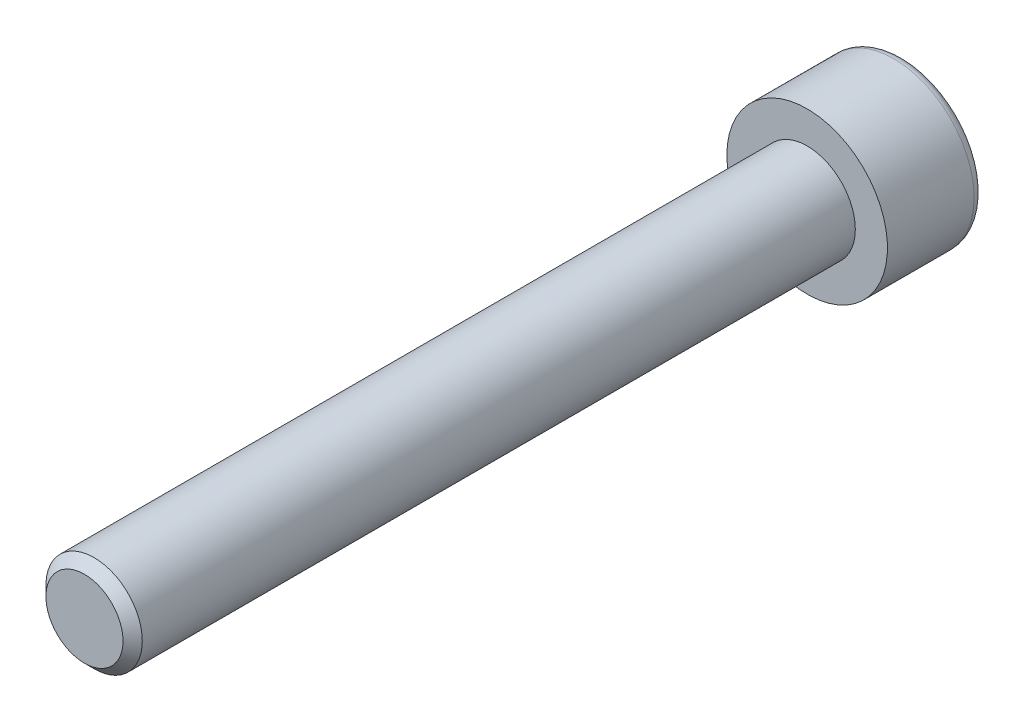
from build123d import *

# Parameters (mm, degrees)
ENLEV_MAT_EXTRU1_DEPTH = 3
ESQUISSE3_W            = 3
ESQUISSE3_H            = 45
CHANFREIN1_SIZE        = 0.6


with BuildPart() as part:
    # Esquisse1 → Base-R_volution (revolve)
    with BuildSketch(Plane(origin=(0, 0, 0), x_dir=(1, 0, 0), z_dir=(0, 1, 0)), mode=Mode.PRIVATE) as base_r_volution_sk:
        with BuildLine():
            Line((0, 0), (5, 0))
            Line((5, 0), (5, 5.4))
            ThreePointArc((5, 5.4), (4.824264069, 5.824264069), (4.4, 6))
            Line((4.4, 6), (0, 6))
            Line((0, 6), (0, 0))
        make_face()
    revolve(base_r_volution_sk.sketch.rotate(Axis((0, 0, 0), (0, 0, -1)), 180), axis=Axis((0, 0, 0), (0, 0, -1)))

    # Esquisse2 → enlev-mat-Extru1 (cut)
    with BuildSketch(Plane.XY.offset(-6)):
        Polygon((2.5, -1.443375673), (2.5, 1.443375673), (0, 2.886751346), (-2.5, 1.443375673), (-2.5, -1.443375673), (0, -2.886751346), align=None)
    extrude(amount=ENLEV_MAT_EXTRU1_DEPTH, mode=Mode.SUBTRACT)

    # Esquisse3 → Boss.-R_vol.1 (revolve)
    with BuildSketch(Plane(origin=(0, 0, 0), x_dir=(1, 0, 0), z_dir=(0, 1, 0))):
        with Locations((1.5, -22.5)):
            Rectangle(ESQUISSE3_W, ESQUISSE3_H)
    revolve(axis=Axis((0, 0, 0), (0, 0, 1)))

    # Chanfrein1
    chanfrein1_edges = [part.edges().sort_by_distance(p)[0] for p in [
        (-3, 0, 45),
    ]]
    chamfer(chanfrein1_edges, length=CHANFREIN1_SIZE)


solid = part.part
